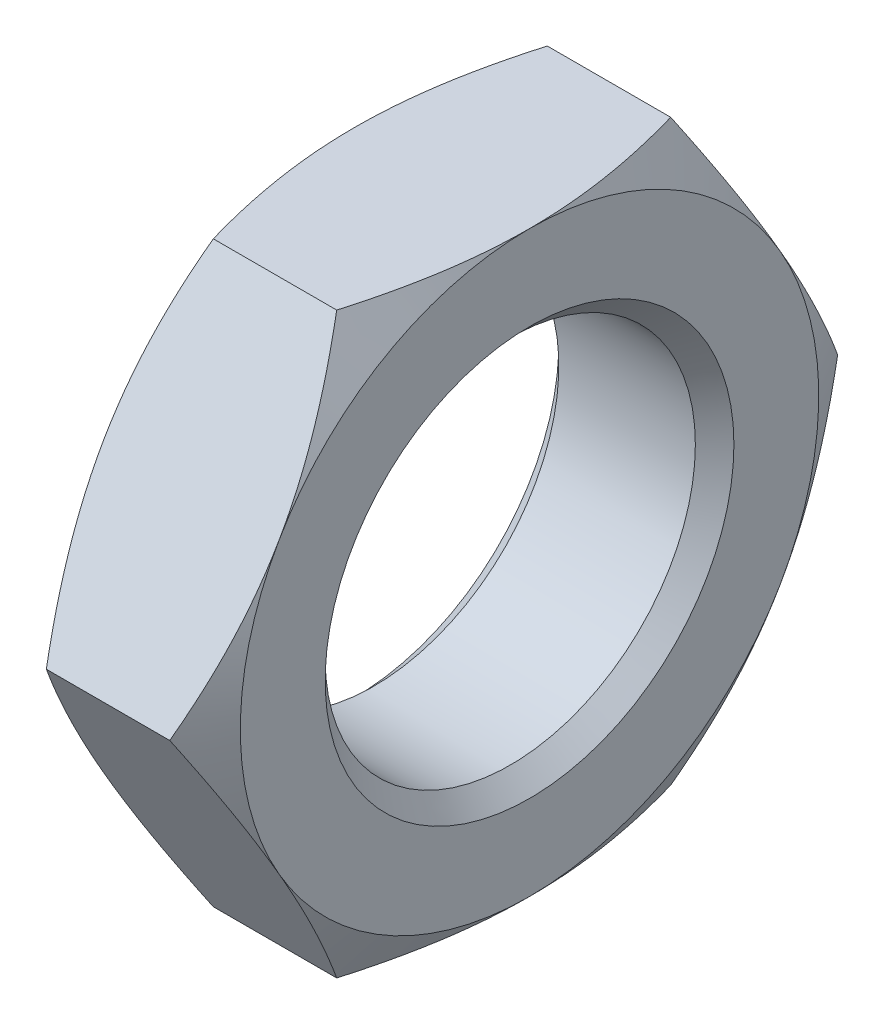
from build123d import *

# Parameters (mm, degrees)
SKETCH1_R      = 24
EXTRUDE1_DEPTH = 22.7
CHAMFER1_SIZE  = 2.5


with BuildPart() as part:
    # Sketch1 → Extrude1 (new body)
    with BuildSketch(Plane(origin=(0, 0, 0), x_dir=(0, 0, -1), z_dir=(1, 0, 0))):
        Polygon((21.650635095, 37.5), (-21.650635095, 37.5), (-43.301270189, 0), (-21.650635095, -37.5), (21.650635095, -37.5), (43.301270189, 0), align=None)
        Circle(SKETCH1_R, mode=Mode.SUBTRACT)
    extrude(amount=EXTRUDE1_DEPTH)

    # Sketch2 → Cut-Revolve1 (revolve, cut)
    with BuildSketch(Plane.XY):
        Polygon((22.7, 37.5), (22.7, 150), (0, 150), (0, 37.5), (11.35, 57.158776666), align=None)
    revolve(axis=Axis((22.7, 0, 0), (-1, 0, 0)), mode=Mode.SUBTRACT)

    # Chamfer1
    chamfer1_edges = [part.edges().sort_by_distance(p)[0] for p in [
        (0, 0, 24),
        (22.7, 0, 24),
    ]]
    chamfer(chamfer1_edges, length=CHAMFER1_SIZE)


solid = part.part
